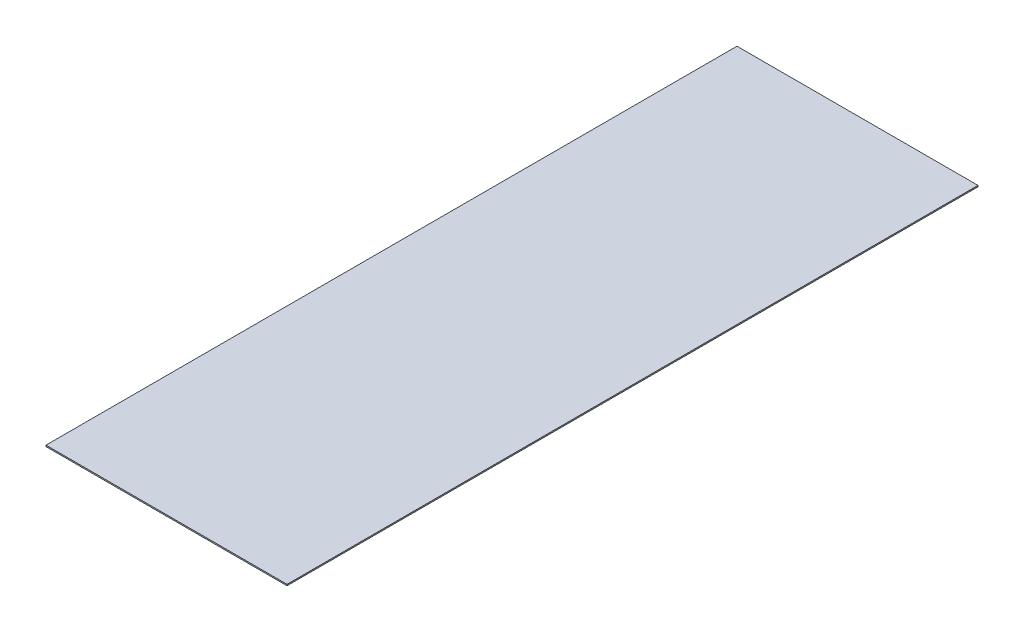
ISO-10303-21;
HEADER;
FILE_DESCRIPTION(('STEP AP214'),'2;1');
FILE_NAME('part.step','',(''),(''),'','','');
FILE_SCHEMA(('AUTOMOTIVE_DESIGN { 1 0 10303 214 1 1 1 1 }'));
ENDSEC;
DATA;
#1=APPLICATION_CONTEXT('core data for automotive mechanical design processes');
#2=APPLICATION_PROTOCOL_DEFINITION('international standard','automotive_design',2000,#1);
#3=PRODUCT_CONTEXT('',#1,'mechanical');
#4=PRODUCT('Part','Part','',(#3));
#5=PRODUCT_RELATED_PRODUCT_CATEGORY('part','',(#4));
#6=PRODUCT_DEFINITION_FORMATION('','',#4);
#7=PRODUCT_DEFINITION_CONTEXT('part definition',#1,'design');
#8=PRODUCT_DEFINITION('design','',#6,#7);
#9=PRODUCT_DEFINITION_SHAPE('','',#8);
#10=(LENGTH_UNIT() NAMED_UNIT(*) SI_UNIT(.MILLI.,.METRE.));
#11=(NAMED_UNIT(*) PLANE_ANGLE_UNIT() SI_UNIT($,.RADIAN.));
#12=(NAMED_UNIT(*) SI_UNIT($,.STERADIAN.) SOLID_ANGLE_UNIT());
#13=UNCERTAINTY_MEASURE_WITH_UNIT(LENGTH_MEASURE(1.E-05),#10,'distance_accuracy_value','');
#14=(GEOMETRIC_REPRESENTATION_CONTEXT(3) GLOBAL_UNCERTAINTY_ASSIGNED_CONTEXT((#13)) GLOBAL_UNIT_ASSIGNED_CONTEXT((#10,
#11,#12)) REPRESENTATION_CONTEXT('',''));
#15=CARTESIAN_POINT('',(0.,0.,0.));
#16=DIRECTION('',(0.,0.,1.));
#17=DIRECTION('',(1.,0.,0.));
#18=AXIS2_PLACEMENT_3D('',#15,#16,#17);
#19=CARTESIAN_POINT('',(0.,0.254,76.2));
#20=DIRECTION('',(0.,0.,-1.));
#21=DIRECTION('',(-1.,0.,0.));
#22=AXIS2_PLACEMENT_3D('',#19,#20,#21);
#23=PLANE('',#22);
#24=DIRECTION('',(1.,0.,0.));
#25=VECTOR('',#24,1.);
#26=CARTESIAN_POINT('',(0.,0.,76.2));
#27=LINE('',#26,#25);
#28=CARTESIAN_POINT('',(19.05,0.,76.2));
#29=VERTEX_POINT('',#28);
#30=CARTESIAN_POINT('',(66.675,0.,76.2));
#31=VERTEX_POINT('',#30);
#32=EDGE_CURVE('E97',#29,#31,#27,.T.);
#33=ORIENTED_EDGE('',*,*,#32,.T.);
#34=DIRECTION('',(0.,-1.,0.));
#35=VECTOR('',#34,1.);
#36=CARTESIAN_POINT('',(66.675,0.254,76.2));
#37=LINE('',#36,#35);
#38=CARTESIAN_POINT('',(66.675,0.254,76.2));
#39=VERTEX_POINT('',#38);
#40=EDGE_CURVE('E11',#39,#31,#37,.T.);
#41=ORIENTED_EDGE('',*,*,#40,.F.);
#42=DIRECTION('',(1.,0.,0.));
#43=VECTOR('',#42,1.);
#44=CARTESIAN_POINT('',(0.,0.254,76.2));
#45=LINE('',#44,#43);
#46=CARTESIAN_POINT('',(19.05,0.254,76.2));
#47=VERTEX_POINT('',#46);
#48=EDGE_CURVE('E83',#47,#39,#45,.T.);
#49=ORIENTED_EDGE('',*,*,#48,.F.);
#50=DIRECTION('',(0.,-1.,0.));
#51=VECTOR('',#50,1.);
#52=CARTESIAN_POINT('',(19.05,0.254,76.2));
#53=LINE('',#52,#51);
#54=EDGE_CURVE('E50',#47,#29,#53,.T.);
#55=ORIENTED_EDGE('',*,*,#54,.T.);
#56=EDGE_LOOP('',(#33,#41,#49,#55));
#57=FACE_BOUND('',#56,.T.);
#58=ADVANCED_FACE('F34',(#57),#23,.F.);
#59=CARTESIAN_POINT('',(66.675,0.254,0.));
#60=DIRECTION('',(-1.,0.,0.));
#61=DIRECTION('',(0.,0.,1.));
#62=AXIS2_PLACEMENT_3D('',#59,#60,#61);
#63=PLANE('',#62);
#64=DIRECTION('',(0.,0.,-1.));
#65=VECTOR('',#64,1.);
#66=CARTESIAN_POINT('',(66.675,0.,0.));
#67=LINE('',#66,#65);
#68=CARTESIAN_POINT('',(66.675,0.,-60.325));
#69=VERTEX_POINT('',#68);
#70=EDGE_CURVE('E88',#31,#69,#67,.T.);
#71=ORIENTED_EDGE('',*,*,#70,.T.);
#72=DIRECTION('',(0.,-1.,0.));
#73=VECTOR('',#72,1.);
#74=CARTESIAN_POINT('',(66.675,0.254,-60.325));
#75=LINE('',#74,#73);
#76=CARTESIAN_POINT('',(66.675,0.254,-60.325));
#77=VERTEX_POINT('',#76);
#78=EDGE_CURVE('E42',#77,#69,#75,.T.);
#79=ORIENTED_EDGE('',*,*,#78,.F.);
#80=DIRECTION('',(0.,0.,-1.));
#81=VECTOR('',#80,1.);
#82=CARTESIAN_POINT('',(66.675,0.254,0.));
#83=LINE('',#82,#81);
#84=EDGE_CURVE('E75',#39,#77,#83,.T.);
#85=ORIENTED_EDGE('',*,*,#84,.F.);
#86=ORIENTED_EDGE('',*,*,#40,.T.);
#87=EDGE_LOOP('',(#71,#79,#85,#86));
#88=FACE_BOUND('',#87,.T.);
#89=ADVANCED_FACE('F87',(#88),#63,.F.);
#90=CARTESIAN_POINT('',(0.,0.254,-60.325));
#91=DIRECTION('',(0.,0.,-1.));
#92=DIRECTION('',(-1.,0.,0.));
#93=AXIS2_PLACEMENT_3D('',#90,#91,#92);
#94=PLANE('',#93);
#95=DIRECTION('',(1.,0.,0.));
#96=VECTOR('',#95,1.);
#97=CARTESIAN_POINT('',(0.,0.,-60.325));
#98=LINE('',#97,#96);
#99=CARTESIAN_POINT('',(19.05,0.,-60.325));
#100=VERTEX_POINT('',#99);
#101=EDGE_CURVE('E100',#100,#69,#98,.T.);
#102=ORIENTED_EDGE('',*,*,#101,.F.);
#103=DIRECTION('',(0.,-1.,0.));
#104=VECTOR('',#103,1.);
#105=CARTESIAN_POINT('',(19.05,0.254,-60.325));
#106=LINE('',#105,#104);
#107=CARTESIAN_POINT('',(19.05,0.254,-60.325));
#108=VERTEX_POINT('',#107);
#109=EDGE_CURVE('E64',#108,#100,#106,.T.);
#110=ORIENTED_EDGE('',*,*,#109,.F.);
#111=DIRECTION('',(1.,0.,0.));
#112=VECTOR('',#111,1.);
#113=CARTESIAN_POINT('',(0.,0.254,-60.325));
#114=LINE('',#113,#112);
#115=EDGE_CURVE('E82',#108,#77,#114,.T.);
#116=ORIENTED_EDGE('',*,*,#115,.T.);
#117=ORIENTED_EDGE('',*,*,#78,.T.);
#118=EDGE_LOOP('',(#102,#110,#116,#117));
#119=FACE_BOUND('',#118,.T.);
#120=ADVANCED_FACE('F91',(#119),#94,.T.);
#121=CARTESIAN_POINT('',(19.05,0.254,0.));
#122=DIRECTION('',(-1.,0.,0.));
#123=DIRECTION('',(0.,0.,1.));
#124=AXIS2_PLACEMENT_3D('',#121,#122,#123);
#125=PLANE('',#124);
#126=DIRECTION('',(0.,0.,-1.));
#127=VECTOR('',#126,1.);
#128=CARTESIAN_POINT('',(19.05,0.,0.));
#129=LINE('',#128,#127);
#130=EDGE_CURVE('E102',#29,#100,#129,.T.);
#131=ORIENTED_EDGE('',*,*,#130,.F.);
#132=ORIENTED_EDGE('',*,*,#54,.F.);
#133=DIRECTION('',(0.,0.,-1.));
#134=VECTOR('',#133,1.);
#135=CARTESIAN_POINT('',(19.05,0.254,0.));
#136=LINE('',#135,#134);
#137=EDGE_CURVE('E92',#47,#108,#136,.T.);
#138=ORIENTED_EDGE('',*,*,#137,.T.);
#139=ORIENTED_EDGE('',*,*,#109,.T.);
#140=EDGE_LOOP('',(#131,#132,#138,#139));
#141=FACE_BOUND('',#140,.T.);
#142=ADVANCED_FACE('F108',(#141),#125,.T.);
#143=CARTESIAN_POINT('',(0.,0.254,0.));
#144=DIRECTION('',(0.,1.,0.));
#145=DIRECTION('',(0.,0.,1.));
#146=AXIS2_PLACEMENT_3D('',#143,#144,#145);
#147=PLANE('',#146);
#148=ORIENTED_EDGE('',*,*,#48,.T.);
#149=ORIENTED_EDGE('',*,*,#84,.T.);
#150=ORIENTED_EDGE('',*,*,#115,.F.);
#151=ORIENTED_EDGE('',*,*,#137,.F.);
#152=EDGE_LOOP('',(#148,#149,#150,#151));
#153=FACE_BOUND('',#152,.T.);
#154=ADVANCED_FACE('F79',(#153),#147,.T.);
#155=CARTESIAN_POINT('',(0.,0.,0.));
#156=DIRECTION('',(0.,1.,0.));
#157=DIRECTION('',(0.,0.,1.));
#158=AXIS2_PLACEMENT_3D('',#155,#156,#157);
#159=PLANE('',#158);
#160=ORIENTED_EDGE('',*,*,#32,.F.);
#161=ORIENTED_EDGE('',*,*,#130,.T.);
#162=ORIENTED_EDGE('',*,*,#101,.T.);
#163=ORIENTED_EDGE('',*,*,#70,.F.);
#164=EDGE_LOOP('',(#160,#161,#162,#163));
#165=FACE_BOUND('',#164,.T.);
#166=ADVANCED_FACE('F107',(#165),#159,.F.);
#167=CLOSED_SHELL('',(#58,#89,#120,#142,#154,#166));
#168=MANIFOLD_SOLID_BREP('B2',#167);
#169=ADVANCED_BREP_SHAPE_REPRESENTATION('',(#18,#168),#14);
#170=SHAPE_DEFINITION_REPRESENTATION(#9,#169);
ENDSEC;
END-ISO-10303-21;
